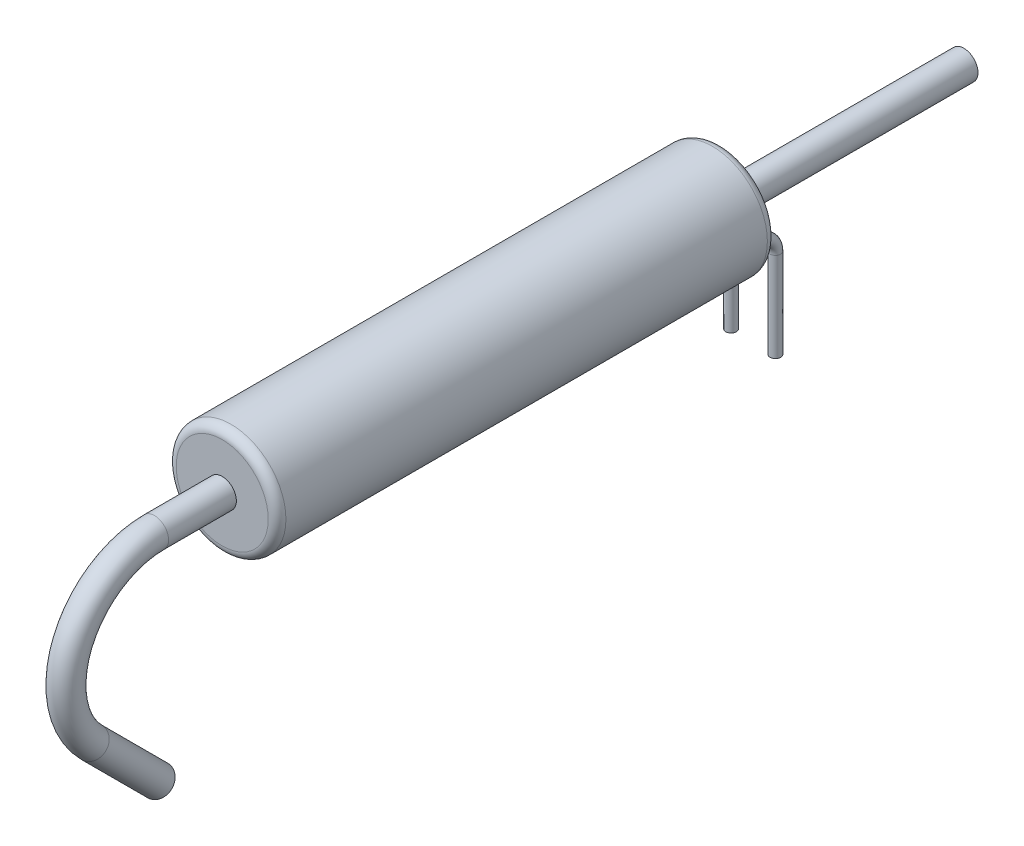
ISO-10303-21;
HEADER;
FILE_DESCRIPTION(('STEP AP214'),'2;1');
FILE_NAME('part.step','',(''),(''),'','','');
FILE_SCHEMA(('AUTOMOTIVE_DESIGN { 1 0 10303 214 1 1 1 1 }'));
ENDSEC;
DATA;
#1=APPLICATION_CONTEXT('core data for automotive mechanical design processes');
#2=APPLICATION_PROTOCOL_DEFINITION('international standard','automotive_design',2000,#1);
#3=PRODUCT_CONTEXT('',#1,'mechanical');
#4=PRODUCT('Part','Part','',(#3));
#5=PRODUCT_RELATED_PRODUCT_CATEGORY('part','',(#4));
#6=PRODUCT_DEFINITION_FORMATION('','',#4);
#7=PRODUCT_DEFINITION_CONTEXT('part definition',#1,'design');
#8=PRODUCT_DEFINITION('design','',#6,#7);
#9=PRODUCT_DEFINITION_SHAPE('','',#8);
#10=(LENGTH_UNIT() NAMED_UNIT(*) SI_UNIT(.MILLI.,.METRE.));
#11=(NAMED_UNIT(*) PLANE_ANGLE_UNIT() SI_UNIT($,.RADIAN.));
#12=(NAMED_UNIT(*) SI_UNIT($,.STERADIAN.) SOLID_ANGLE_UNIT());
#13=UNCERTAINTY_MEASURE_WITH_UNIT(LENGTH_MEASURE(1.E-05),#10,'distance_accuracy_value','');
#14=(GEOMETRIC_REPRESENTATION_CONTEXT(3) GLOBAL_UNCERTAINTY_ASSIGNED_CONTEXT((#13)) GLOBAL_UNIT_ASSIGNED_CONTEXT((#10,
#11,#12)) REPRESENTATION_CONTEXT('',''));
#15=CARTESIAN_POINT('',(0.,0.,0.));
#16=DIRECTION('',(0.,0.,1.));
#17=DIRECTION('',(1.,0.,0.));
#18=AXIS2_PLACEMENT_3D('',#15,#16,#17);
#19=CARTESIAN_POINT('',(0.,0.,-26.7));
#20=DIRECTION('',(0.,0.,1.));
#21=DIRECTION('',(1.,0.,0.));
#22=AXIS2_PLACEMENT_3D('',#19,#20,#21);
#23=CYLINDRICAL_SURFACE('',#22,0.8);
#24=CARTESIAN_POINT('',(0.,0.,0.));
#25=DIRECTION('',(0.,0.,1.));
#26=DIRECTION('',(1.,0.,0.));
#27=AXIS2_PLACEMENT_3D('',#24,#25,#26);
#28=CIRCLE('',#27,0.8);
#29=CARTESIAN_POINT('',(0.8,0.,0.));
#30=VERTEX_POINT('',#29);
#31=EDGE_CURVE('E96',#30,#30,#28,.F.);
#32=CARTESIAN_POINT('',(0.,0.,-13.7));
#33=DIRECTION('',(0.,0.,-1.));
#34=DIRECTION('',(-1.,0.,0.));
#35=AXIS2_PLACEMENT_3D('',#32,#33,#34);
#36=CIRCLE('',#35,0.8);
#37=CARTESIAN_POINT('',(0.8,0.,-13.7));
#38=VERTEX_POINT('',#37);
#39=EDGE_CURVE('E63',#38,#38,#36,.T.);
#40=CARTESIAN_POINT('',(0.8,0.,0.));
#41=CARTESIAN_POINT('',(0.8,0.,-0.142708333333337));
#42=CARTESIAN_POINT('',(0.8,0.,-0.285416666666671));
#43=CARTESIAN_POINT('',(0.8,0.,-0.570833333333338));
#44=CARTESIAN_POINT('',(0.8,0.,-0.71354166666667));
#45=CARTESIAN_POINT('',(0.8,0.,-0.998958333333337));
#46=CARTESIAN_POINT('',(0.8,0.,-1.14166666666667));
#47=CARTESIAN_POINT('',(0.8,0.,-1.42708333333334));
#48=CARTESIAN_POINT('',(0.8,0.,-1.56979166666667));
#49=CARTESIAN_POINT('',(0.8,0.,-1.85520833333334));
#50=CARTESIAN_POINT('',(0.8,0.,-1.99791666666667));
#51=CARTESIAN_POINT('',(0.8,0.,-2.28333333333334));
#52=CARTESIAN_POINT('',(0.8,0.,-2.42604166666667));
#53=CARTESIAN_POINT('',(0.8,0.,-2.71145833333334));
#54=CARTESIAN_POINT('',(0.8,0.,-2.85416666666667));
#55=CARTESIAN_POINT('',(0.8,0.,-3.13958333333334));
#56=CARTESIAN_POINT('',(0.8,0.,-3.28229166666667));
#57=CARTESIAN_POINT('',(0.8,0.,-3.56770833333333));
#58=CARTESIAN_POINT('',(0.8,0.,-3.71041666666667));
#59=CARTESIAN_POINT('',(0.8,0.,-3.99583333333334));
#60=CARTESIAN_POINT('',(0.8,0.,-4.13854166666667));
#61=CARTESIAN_POINT('',(0.8,0.,-4.42395833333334));
#62=CARTESIAN_POINT('',(0.8,0.,-4.56666666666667));
#63=CARTESIAN_POINT('',(0.8,0.,-4.85208333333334));
#64=CARTESIAN_POINT('',(0.8,0.,-4.99479166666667));
#65=CARTESIAN_POINT('',(0.8,0.,-5.28020833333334));
#66=CARTESIAN_POINT('',(0.8,0.,-5.42291666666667));
#67=CARTESIAN_POINT('',(0.8,0.,-5.70833333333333));
#68=CARTESIAN_POINT('',(0.8,0.,-5.85104166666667));
#69=CARTESIAN_POINT('',(0.8,0.,-6.13645833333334));
#70=CARTESIAN_POINT('',(0.8,0.,-6.27916666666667));
#71=CARTESIAN_POINT('',(0.8,0.,-6.56458333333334));
#72=CARTESIAN_POINT('',(0.8,0.,-6.70729166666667));
#73=CARTESIAN_POINT('',(0.8,0.,-6.99270833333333));
#74=CARTESIAN_POINT('',(0.8,0.,-7.13541666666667));
#75=CARTESIAN_POINT('',(0.8,0.,-7.42083333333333));
#76=CARTESIAN_POINT('',(0.8,0.,-7.56354166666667));
#77=CARTESIAN_POINT('',(0.8,0.,-7.84895833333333));
#78=CARTESIAN_POINT('',(0.8,0.,-7.99166666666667));
#79=CARTESIAN_POINT('',(0.8,0.,-8.27708333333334));
#80=CARTESIAN_POINT('',(0.8,0.,-8.41979166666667));
#81=CARTESIAN_POINT('',(0.8,0.,-8.70520833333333));
#82=CARTESIAN_POINT('',(0.8,0.,-8.84791666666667));
#83=CARTESIAN_POINT('',(0.8,0.,-9.13333333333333));
#84=CARTESIAN_POINT('',(0.8,0.,-9.27604166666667));
#85=CARTESIAN_POINT('',(0.8,0.,-9.56145833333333));
#86=CARTESIAN_POINT('',(0.8,0.,-9.70416666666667));
#87=CARTESIAN_POINT('',(0.8,0.,-9.98958333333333));
#88=CARTESIAN_POINT('',(0.8,0.,-10.1322916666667));
#89=CARTESIAN_POINT('',(0.8,0.,-10.4177083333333));
#90=CARTESIAN_POINT('',(0.8,0.,-10.5604166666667));
#91=CARTESIAN_POINT('',(0.8,0.,-10.8458333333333));
#92=CARTESIAN_POINT('',(0.8,0.,-10.9885416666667));
#93=CARTESIAN_POINT('',(0.8,0.,-11.2739583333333));
#94=CARTESIAN_POINT('',(0.8,0.,-11.4166666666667));
#95=CARTESIAN_POINT('',(0.8,0.,-11.7020833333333));
#96=CARTESIAN_POINT('',(0.8,0.,-11.8447916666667));
#97=CARTESIAN_POINT('',(0.8,0.,-12.1302083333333));
#98=CARTESIAN_POINT('',(0.8,0.,-12.2729166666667));
#99=CARTESIAN_POINT('',(0.8,0.,-12.5583333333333));
#100=CARTESIAN_POINT('',(0.8,0.,-12.7010416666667));
#101=CARTESIAN_POINT('',(0.8,0.,-12.9864583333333));
#102=CARTESIAN_POINT('',(0.8,0.,-13.1291666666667));
#103=CARTESIAN_POINT('',(0.8,0.,-13.4145833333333));
#104=CARTESIAN_POINT('',(0.8,0.,-13.5572916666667));
#105=CARTESIAN_POINT('',(0.8,0.,-13.7));
#106=B_SPLINE_CURVE_WITH_KNOTS('',3,(#40,#41,#42,#43,#44,#45,#46,#47,#48,#49,#50,#51,#52,#53,
#54,#55,#56,#57,#58,#59,#60,#61,#62,#63,#64,#65,#66,#67,#68,#69,#70,#71,#72,#73,#74,#75,#76,#77,
#78,#79,#80,#81,#82,#83,#84,#85,#86,#87,#88,#89,#90,#91,#92,#93,#94,#95,#96,#97,#98,#99,#100,
#101,#102,#103,#104,#105),.UNSPECIFIED.,.F.,.F.,(4,2,2,2,2,2,2,2,2,2,2,2,2,2,2,2,2,2,2,2,2,2,2,
2,2,2,2,2,2,2,2,2,4),(0.,0.428125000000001,0.856249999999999,1.284375,1.7125,2.140625,2.56875,
2.996875,3.425,3.853125,4.28125,4.709375,5.1375,5.565625,5.99375,6.421875,6.85,7.278125,7.70625,
8.134375,8.5625,8.990625,9.41875,9.846875,10.275,10.703125,11.13125,11.559375,11.9875,12.415625,
12.84375,13.271875,13.7),.UNSPECIFIED.);
#107=EDGE_CURVE('BSEAM41',#30,#38,#106,.T.);
#108=ORIENTED_EDGE('',*,*,#31,.T.);
#109=ORIENTED_EDGE('',*,*,#39,.F.);
#110=ORIENTED_EDGE('',*,*,#107,.T.);
#111=ORIENTED_EDGE('',*,*,#107,.F.);
#112=EDGE_LOOP('',(#108,#110,#109,#111));
#113=FACE_BOUND('',#112,.T.);
#114=ADVANCED_FACE('F41',(#113),#23,.T.);
#115=CARTESIAN_POINT('',(0.,0.,0.));
#116=DIRECTION('',(0.,0.,1.));
#117=DIRECTION('',(1.,0.,0.));
#118=AXIS2_PLACEMENT_3D('',#115,#116,#117);
#119=PLANE('',#118);
#120=CARTESIAN_POINT('',(0.,0.,0.));
#121=DIRECTION('',(0.,0.,1.));
#122=DIRECTION('',(1.,0.,0.));
#123=AXIS2_PLACEMENT_3D('',#120,#121,#122);
#124=CIRCLE('',#123,2.6);
#125=CARTESIAN_POINT('',(2.6,0.,0.));
#126=VERTEX_POINT('',#125);
#127=EDGE_CURVE('E45',#126,#126,#124,.F.);
#128=ORIENTED_EDGE('',*,*,#127,.T.);
#129=EDGE_LOOP('',(#128));
#130=FACE_BOUND('',#129,.T.);
#131=CARTESIAN_POINT('',(-1.25,-1.55,0.));
#132=DIRECTION('',(0.,0.,1.));
#133=DIRECTION('',(1.,0.,0.));
#134=AXIS2_PLACEMENT_3D('',#131,#132,#133);
#135=CIRCLE('',#134,0.3);
#136=CARTESIAN_POINT('',(-0.95,-1.55,0.));
#137=VERTEX_POINT('',#136);
#138=EDGE_CURVE('E92',#137,#137,#135,.T.);
#139=ORIENTED_EDGE('',*,*,#138,.T.);
#140=EDGE_LOOP('',(#139));
#141=FACE_BOUND('',#140,.T.);
#142=CARTESIAN_POINT('',(1.25,-1.55,0.));
#143=DIRECTION('',(0.,0.,1.));
#144=DIRECTION('',(1.,0.,0.));
#145=AXIS2_PLACEMENT_3D('',#142,#143,#144);
#146=CIRCLE('',#145,0.3);
#147=CARTESIAN_POINT('',(1.55,-1.55,0.));
#148=VERTEX_POINT('',#147);
#149=EDGE_CURVE('E80',#148,#148,#146,.T.);
#150=ORIENTED_EDGE('',*,*,#149,.T.);
#151=EDGE_LOOP('',(#150));
#152=FACE_BOUND('',#151,.T.);
#153=ORIENTED_EDGE('',*,*,#31,.F.);
#154=EDGE_LOOP('',(#153));
#155=FACE_BOUND('',#154,.T.);
#156=ADVANCED_FACE('F118',(#130,#141,#152,#155),#119,.F.);
#157=CARTESIAN_POINT('',(0.,0.,0.));
#158=DIRECTION('',(0.,0.,1.));
#159=DIRECTION('',(1.,0.,0.));
#160=AXIS2_PLACEMENT_3D('',#157,#158,#159);
#161=CYLINDRICAL_SURFACE('',#160,3.1);
#162=CARTESIAN_POINT('',(0.,0.,27.7));
#163=DIRECTION('',(0.,0.,1.));
#164=DIRECTION('',(1.,0.,0.));
#165=AXIS2_PLACEMENT_3D('',#162,#163,#164);
#166=CIRCLE('',#165,3.1);
#167=CARTESIAN_POINT('',(3.1,0.,27.7));
#168=VERTEX_POINT('',#167);
#169=EDGE_CURVE('E102',#168,#168,#166,.F.);
#170=ORIENTED_EDGE('',*,*,#169,.T.);
#171=EDGE_LOOP('',(#170));
#172=FACE_BOUND('',#171,.T.);
#173=CARTESIAN_POINT('',(0.,0.,0.5));
#174=DIRECTION('',(0.,0.,1.));
#175=DIRECTION('',(1.,0.,0.));
#176=AXIS2_PLACEMENT_3D('',#173,#174,#175);
#177=CIRCLE('',#176,3.1);
#178=CARTESIAN_POINT('',(3.1,0.,0.5));
#179=VERTEX_POINT('',#178);
#180=EDGE_CURVE('E99',#179,#179,#177,.T.);
#181=ORIENTED_EDGE('',*,*,#180,.T.);
#182=EDGE_LOOP('',(#181));
#183=FACE_BOUND('',#182,.T.);
#184=ADVANCED_FACE('F115',(#172,#183),#161,.T.);
#185=CARTESIAN_POINT('',(0.,0.,28.2));
#186=DIRECTION('',(0.,0.,1.));
#187=DIRECTION('',(1.,0.,0.));
#188=AXIS2_PLACEMENT_3D('',#185,#186,#187);
#189=PLANE('',#188);
#190=CARTESIAN_POINT('',(0.,0.,28.2));
#191=DIRECTION('',(0.,0.,1.));
#192=DIRECTION('',(1.,0.,0.));
#193=AXIS2_PLACEMENT_3D('',#190,#191,#192);
#194=CIRCLE('',#193,0.8);
#195=CARTESIAN_POINT('',(0.8,0.,28.2));
#196=VERTEX_POINT('',#195);
#197=EDGE_CURVE('E11',#196,#196,#194,.T.);
#198=ORIENTED_EDGE('',*,*,#197,.F.);
#199=EDGE_LOOP('',(#198));
#200=FACE_BOUND('',#199,.T.);
#201=CARTESIAN_POINT('',(0.,0.,28.2));
#202=DIRECTION('',(0.,0.,1.));
#203=DIRECTION('',(1.,0.,0.));
#204=AXIS2_PLACEMENT_3D('',#201,#202,#203);
#205=CIRCLE('',#204,2.6);
#206=CARTESIAN_POINT('',(2.6,0.,28.2));
#207=VERTEX_POINT('',#206);
#208=EDGE_CURVE('E53',#207,#207,#205,.T.);
#209=ORIENTED_EDGE('',*,*,#208,.T.);
#210=EDGE_LOOP('',(#209));
#211=FACE_BOUND('',#210,.T.);
#212=ADVANCED_FACE('F107',(#200,#211),#189,.T.);
#213=CARTESIAN_POINT('',(-1.25,-1.55,0.));
#214=DIRECTION('',(0.,0.,1.));
#215=DIRECTION('',(1.,0.,0.));
#216=AXIS2_PLACEMENT_3D('',#213,#214,#215);
#217=CYLINDRICAL_SURFACE('',#216,0.3);
#218=CARTESIAN_POINT('',(-1.25,-1.55,-0.8));
#219=DIRECTION('',(0.,0.,1.));
#220=DIRECTION('',(1.,0.,0.));
#221=AXIS2_PLACEMENT_3D('',#218,#219,#220);
#222=CIRCLE('',#221,0.3);
#223=CARTESIAN_POINT('',(-1.25,-1.25,-0.8));
#224=VERTEX_POINT('',#223);
#225=EDGE_CURVE('E88',#224,#224,#222,.F.);
#226=ORIENTED_EDGE('',*,*,#225,.F.);
#227=EDGE_LOOP('',(#226));
#228=FACE_BOUND('',#227,.T.);
#229=ORIENTED_EDGE('',*,*,#138,.F.);
#230=EDGE_LOOP('',(#229));
#231=FACE_BOUND('',#230,.T.);
#232=ADVANCED_FACE('F169',(#228,#231),#217,.T.);
#233=CARTESIAN_POINT('',(-1.25,-2.55,-0.8));
#234=DIRECTION('',(1.,0.,0.));
#235=DIRECTION('',(0.,1.,0.));
#236=AXIS2_PLACEMENT_3D('',#233,#234,#235);
#237=TOROIDAL_SURFACE('',#236,1.,0.3);
#238=CARTESIAN_POINT('',(-1.25,-2.55,-1.8));
#239=DIRECTION('',(0.,1.,0.));
#240=DIRECTION('',(0.,0.,1.));
#241=AXIS2_PLACEMENT_3D('',#238,#239,#240);
#242=CIRCLE('',#241,0.3);
#243=CARTESIAN_POINT('',(-1.25,-2.55,-2.1));
#244=VERTEX_POINT('',#243);
#245=EDGE_CURVE('E84',#244,#244,#242,.F.);
#246=CARTESIAN_POINT('',(-1.25,-2.55,-0.8));
#247=DIRECTION('',(1.,0.,0.));
#248=DIRECTION('',(0.,1.,0.));
#249=AXIS2_PLACEMENT_3D('',#246,#247,#248);
#250=CIRCLE('',#249,1.3);
#251=EDGE_CURVE('',#244,#224,#250,.T.);
#252=ORIENTED_EDGE('',*,*,#245,.F.);
#253=ORIENTED_EDGE('',*,*,#225,.T.);
#254=ORIENTED_EDGE('',*,*,#251,.T.);
#255=ORIENTED_EDGE('',*,*,#251,.F.);
#256=EDGE_LOOP('',(#252,#254,#253,#255));
#257=FACE_BOUND('',#256,.T.);
#258=ADVANCED_FACE('F165',(#257),#237,.T.);
#259=CARTESIAN_POINT('',(1.25,-1.55,0.));
#260=DIRECTION('',(0.,0.,-1.));
#261=DIRECTION('',(0.,-1.,0.));
#262=AXIS2_PLACEMENT_3D('',#259,#260,#261);
#263=CYLINDRICAL_SURFACE('',#262,0.3);
#264=CARTESIAN_POINT('',(1.25,-1.55,-0.8));
#265=DIRECTION('',(0.,0.,1.));
#266=DIRECTION('',(1.,0.,0.));
#267=AXIS2_PLACEMENT_3D('',#264,#265,#266);
#268=CIRCLE('',#267,0.3);
#269=CARTESIAN_POINT('',(1.25,-1.25,-0.8));
#270=VERTEX_POINT('',#269);
#271=EDGE_CURVE('E76',#270,#270,#268,.F.);
#272=ORIENTED_EDGE('',*,*,#271,.F.);
#273=EDGE_LOOP('',(#272));
#274=FACE_BOUND('',#273,.T.);
#275=ORIENTED_EDGE('',*,*,#149,.F.);
#276=EDGE_LOOP('',(#275));
#277=FACE_BOUND('',#276,.T.);
#278=ADVANCED_FACE('F161',(#274,#277),#263,.T.);
#279=CARTESIAN_POINT('',(1.25,-2.55,-0.8));
#280=DIRECTION('',(-1.,0.,0.));
#281=DIRECTION('',(0.,0.,1.));
#282=AXIS2_PLACEMENT_3D('',#279,#280,#281);
#283=TOROIDAL_SURFACE('',#282,1.,0.3);
#284=CARTESIAN_POINT('',(1.25,-2.55,-1.8));
#285=DIRECTION('',(0.,1.,0.));
#286=DIRECTION('',(0.,0.,1.));
#287=AXIS2_PLACEMENT_3D('',#284,#285,#286);
#288=CIRCLE('',#287,0.3);
#289=CARTESIAN_POINT('',(1.25,-2.55,-2.1));
#290=VERTEX_POINT('',#289);
#291=EDGE_CURVE('E72',#290,#290,#288,.F.);
#292=CARTESIAN_POINT('',(1.25,-2.55,-0.8));
#293=DIRECTION('',(-1.,0.,0.));
#294=DIRECTION('',(0.,0.,1.));
#295=AXIS2_PLACEMENT_3D('',#292,#293,#294);
#296=CIRCLE('',#295,1.3);
#297=EDGE_CURVE('',#270,#290,#296,.T.);
#298=ORIENTED_EDGE('',*,*,#271,.T.);
#299=ORIENTED_EDGE('',*,*,#291,.F.);
#300=ORIENTED_EDGE('',*,*,#297,.T.);
#301=ORIENTED_EDGE('',*,*,#297,.F.);
#302=EDGE_LOOP('',(#298,#300,#299,#301));
#303=FACE_BOUND('',#302,.T.);
#304=ADVANCED_FACE('F157',(#303),#283,.T.);
#305=CARTESIAN_POINT('',(-1.25,-7.6,-1.8));
#306=DIRECTION('',(0.,1.,0.));
#307=DIRECTION('',(0.,0.,1.));
#308=AXIS2_PLACEMENT_3D('',#305,#306,#307);
#309=CYLINDRICAL_SURFACE('',#308,0.3);
#310=CARTESIAN_POINT('',(-1.25,-7.6,-1.8));
#311=DIRECTION('',(0.,-1.,0.));
#312=DIRECTION('',(0.,0.,-1.));
#313=AXIS2_PLACEMENT_3D('',#310,#311,#312);
#314=CIRCLE('',#313,0.3);
#315=CARTESIAN_POINT('',(-1.25,-7.6,-2.1));
#316=VERTEX_POINT('',#315);
#317=EDGE_CURVE('E69',#316,#316,#314,.T.);
#318=ORIENTED_EDGE('',*,*,#317,.F.);
#319=EDGE_LOOP('',(#318));
#320=FACE_BOUND('',#319,.T.);
#321=ORIENTED_EDGE('',*,*,#245,.T.);
#322=EDGE_LOOP('',(#321));
#323=FACE_BOUND('',#322,.T.);
#324=ADVANCED_FACE('F153',(#320,#323),#309,.T.);
#325=CARTESIAN_POINT('',(-1.25,-7.6,-1.8));
#326=DIRECTION('',(0.,-1.,0.));
#327=DIRECTION('',(0.,0.,-1.));
#328=AXIS2_PLACEMENT_3D('',#325,#326,#327);
#329=PLANE('',#328);
#330=ORIENTED_EDGE('',*,*,#317,.T.);
#331=EDGE_LOOP('',(#330));
#332=FACE_BOUND('',#331,.T.);
#333=ADVANCED_FACE('F149',(#332),#329,.T.);
#334=CARTESIAN_POINT('',(1.25,-7.6,-1.8));
#335=DIRECTION('',(0.,1.,0.));
#336=DIRECTION('',(0.,0.,1.));
#337=AXIS2_PLACEMENT_3D('',#334,#335,#336);
#338=CYLINDRICAL_SURFACE('',#337,0.3);
#339=CARTESIAN_POINT('',(1.25,-7.6,-1.8));
#340=DIRECTION('',(0.,-1.,0.));
#341=DIRECTION('',(0.,0.,-1.));
#342=AXIS2_PLACEMENT_3D('',#339,#340,#341);
#343=CIRCLE('',#342,0.3);
#344=CARTESIAN_POINT('',(1.25,-7.6,-2.1));
#345=VERTEX_POINT('',#344);
#346=EDGE_CURVE('E66',#345,#345,#343,.T.);
#347=ORIENTED_EDGE('',*,*,#346,.F.);
#348=EDGE_LOOP('',(#347));
#349=FACE_BOUND('',#348,.T.);
#350=ORIENTED_EDGE('',*,*,#291,.T.);
#351=EDGE_LOOP('',(#350));
#352=FACE_BOUND('',#351,.T.);
#353=ADVANCED_FACE('F145',(#349,#352),#338,.T.);
#354=CARTESIAN_POINT('',(1.25,-7.6,-1.8));
#355=DIRECTION('',(0.,-1.,0.));
#356=DIRECTION('',(0.,0.,-1.));
#357=AXIS2_PLACEMENT_3D('',#354,#355,#356);
#358=PLANE('',#357);
#359=ORIENTED_EDGE('',*,*,#346,.T.);
#360=EDGE_LOOP('',(#359));
#361=FACE_BOUND('',#360,.T.);
#362=ADVANCED_FACE('F112',(#361),#358,.T.);
#363=CARTESIAN_POINT('',(0.,0.,27.7));
#364=DIRECTION('',(0.,0.,1.));
#365=DIRECTION('',(1.,0.,0.));
#366=AXIS2_PLACEMENT_3D('',#363,#364,#365);
#367=TOROIDAL_SURFACE('',#366,2.6,0.5);
#368=ORIENTED_EDGE('',*,*,#208,.F.);
#369=EDGE_LOOP('',(#368));
#370=FACE_BOUND('',#369,.T.);
#371=ORIENTED_EDGE('',*,*,#169,.F.);
#372=EDGE_LOOP('',(#371));
#373=FACE_BOUND('',#372,.T.);
#374=ADVANCED_FACE('F109',(#370,#373),#367,.T.);
#375=CARTESIAN_POINT('',(0.,0.,0.5));
#376=DIRECTION('',(0.,0.,1.));
#377=DIRECTION('',(1.,0.,0.));
#378=AXIS2_PLACEMENT_3D('',#375,#376,#377);
#379=TOROIDAL_SURFACE('',#378,2.6,0.5);
#380=ORIENTED_EDGE('',*,*,#127,.F.);
#381=EDGE_LOOP('',(#380));
#382=FACE_BOUND('',#381,.T.);
#383=ORIENTED_EDGE('',*,*,#180,.F.);
#384=EDGE_LOOP('',(#383));
#385=FACE_BOUND('',#384,.T.);
#386=ADVANCED_FACE('F43',(#382,#385),#379,.T.);
#387=CARTESIAN_POINT('',(0.,0.,-13.7));
#388=DIRECTION('',(0.,0.,-1.));
#389=DIRECTION('',(-1.,0.,0.));
#390=AXIS2_PLACEMENT_3D('',#387,#388,#389);
#391=PLANE('',#390);
#392=ORIENTED_EDGE('',*,*,#39,.T.);
#393=EDGE_LOOP('',(#392));
#394=FACE_BOUND('',#393,.T.);
#395=ADVANCED_FACE('F123',(#394),#391,.T.);
#396=CARTESIAN_POINT('',(0.,-8.53553390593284,35.5644660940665));
#397=DIRECTION('',(0.,-0.707106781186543,-0.707106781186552));
#398=DIRECTION('',(0.,0.707106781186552,-0.707106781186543));
#399=AXIS2_PLACEMENT_3D('',#396,#397,#398);
#400=CYLINDRICAL_SURFACE('',#399,0.8);
#401=CARTESIAN_POINT('',(0.,-8.53553390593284,35.5644660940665));
#402=DIRECTION('',(0.,-0.70710678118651,-0.707106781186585));
#403=DIRECTION('',(1.,0.,0.));
#404=AXIS2_PLACEMENT_3D('',#401,#402,#403);
#405=CIRCLE('',#404,0.8);
#406=CARTESIAN_POINT('',(0.,-9.10121933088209,36.1301515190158));
#407=VERTEX_POINT('',#406);
#408=EDGE_CURVE('E57',#407,#407,#405,.T.);
#409=ORIENTED_EDGE('',*,*,#408,.T.);
#410=EDGE_LOOP('',(#409));
#411=FACE_BOUND('',#410,.T.);
#412=CARTESIAN_POINT('',(0.,-12.2590479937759,31.8409520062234));
#413=DIRECTION('',(0.,-0.70710678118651,-0.707106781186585));
#414=DIRECTION('',(1.,0.,0.));
#415=AXIS2_PLACEMENT_3D('',#412,#413,#414);
#416=CIRCLE('',#415,0.8);
#417=CARTESIAN_POINT('',(0.8,-12.2590479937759,31.8409520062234));
#418=VERTEX_POINT('',#417);
#419=EDGE_CURVE('E60',#418,#418,#416,.T.);
#420=ORIENTED_EDGE('',*,*,#419,.F.);
#421=EDGE_LOOP('',(#420));
#422=FACE_BOUND('',#421,.T.);
#423=ADVANCED_FACE('F128',(#411,#422),#400,.T.);
#424=CARTESIAN_POINT('',(0.,-5.,32.0289321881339));
#425=DIRECTION('',(1.,0.,0.));
#426=DIRECTION('',(0.,0.,-1.));
#427=AXIS2_PLACEMENT_3D('',#424,#425,#426);
#428=TOROIDAL_SURFACE('',#427,5.,0.8);
#429=CARTESIAN_POINT('',(0.,0.,32.0289321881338));
#430=DIRECTION('',(0.,0.,1.));
#431=DIRECTION('',(1.,0.,0.));
#432=AXIS2_PLACEMENT_3D('',#429,#430,#431);
#433=CIRCLE('',#432,0.8);
#434=CARTESIAN_POINT('',(0.,0.8,32.0289321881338));
#435=VERTEX_POINT('',#434);
#436=EDGE_CURVE('E56',#435,#435,#433,.T.);
#437=CARTESIAN_POINT('',(0.,-5.,32.0289321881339));
#438=DIRECTION('',(1.,0.,0.));
#439=DIRECTION('',(0.,0.,-1.));
#440=AXIS2_PLACEMENT_3D('',#437,#438,#439);
#441=CIRCLE('',#440,5.8);
#442=EDGE_CURVE('',#435,#407,#441,.T.);
#443=ORIENTED_EDGE('',*,*,#436,.T.);
#444=ORIENTED_EDGE('',*,*,#408,.F.);
#445=ORIENTED_EDGE('',*,*,#442,.T.);
#446=ORIENTED_EDGE('',*,*,#442,.F.);
#447=EDGE_LOOP('',(#443,#445,#444,#446));
#448=FACE_BOUND('',#447,.T.);
#449=ADVANCED_FACE('F247',(#448),#428,.T.);
#450=CARTESIAN_POINT('',(0.,0.,32.0289321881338));
#451=DIRECTION('',(0.,0.,-1.));
#452=DIRECTION('',(0.,1.,0.));
#453=AXIS2_PLACEMENT_3D('',#450,#451,#452);
#454=CYLINDRICAL_SURFACE('',#453,0.8);
#455=ORIENTED_EDGE('',*,*,#436,.F.);
#456=EDGE_LOOP('',(#455));
#457=FACE_BOUND('',#456,.T.);
#458=ORIENTED_EDGE('',*,*,#197,.T.);
#459=EDGE_LOOP('',(#458));
#460=FACE_BOUND('',#459,.T.);
#461=ADVANCED_FACE('F254',(#457,#460),#454,.T.);
#462=CARTESIAN_POINT('',(0.,-12.2590479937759,31.8409520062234));
#463=DIRECTION('',(0.,-0.70710678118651,-0.707106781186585));
#464=DIRECTION('',(1.,0.,0.));
#465=AXIS2_PLACEMENT_3D('',#462,#463,#464);
#466=PLANE('',#465);
#467=ORIENTED_EDGE('',*,*,#419,.T.);
#468=EDGE_LOOP('',(#467));
#469=FACE_BOUND('',#468,.T.);
#470=ADVANCED_FACE('F262',(#469),#466,.T.);
#471=CLOSED_SHELL('',(#114,#156,#184,#212,#232,#258,#278,#304,#324,#333,#353,#362,#374,#386,
#395,#423,#449,#461,#470));
#472=MANIFOLD_SOLID_BREP('B2',#471);
#473=ADVANCED_BREP_SHAPE_REPRESENTATION('',(#18,#472),#14);
#474=SHAPE_DEFINITION_REPRESENTATION(#9,#473);
ENDSEC;
END-ISO-10303-21;
